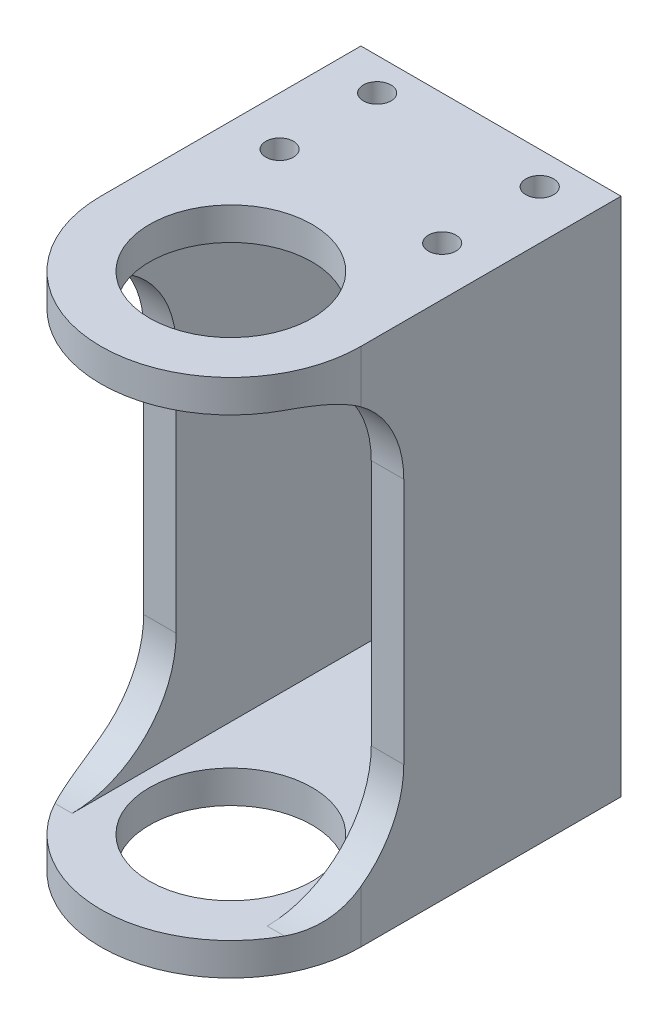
ISO-10303-21;
HEADER;
FILE_DESCRIPTION(('STEP AP214'),'2;1');
FILE_NAME('part.step','',(''),(''),'','','');
FILE_SCHEMA(('AUTOMOTIVE_DESIGN { 1 0 10303 214 1 1 1 1 }'));
ENDSEC;
DATA;
#1=APPLICATION_CONTEXT('core data for automotive mechanical design processes');
#2=APPLICATION_PROTOCOL_DEFINITION('international standard','automotive_design',2000,#1);
#3=PRODUCT_CONTEXT('',#1,'mechanical');
#4=PRODUCT('Part','Part','',(#3));
#5=PRODUCT_RELATED_PRODUCT_CATEGORY('part','',(#4));
#6=PRODUCT_DEFINITION_FORMATION('','',#4);
#7=PRODUCT_DEFINITION_CONTEXT('part definition',#1,'design');
#8=PRODUCT_DEFINITION('design','',#6,#7);
#9=PRODUCT_DEFINITION_SHAPE('','',#8);
#10=(LENGTH_UNIT() NAMED_UNIT(*) SI_UNIT(.MILLI.,.METRE.));
#11=(NAMED_UNIT(*) PLANE_ANGLE_UNIT() SI_UNIT($,.RADIAN.));
#12=(NAMED_UNIT(*) SI_UNIT($,.STERADIAN.) SOLID_ANGLE_UNIT());
#13=UNCERTAINTY_MEASURE_WITH_UNIT(LENGTH_MEASURE(1.E-05),#10,'distance_accuracy_value','');
#14=(GEOMETRIC_REPRESENTATION_CONTEXT(3) GLOBAL_UNCERTAINTY_ASSIGNED_CONTEXT((#13)) GLOBAL_UNIT_ASSIGNED_CONTEXT((#10,
#11,#12)) REPRESENTATION_CONTEXT('',''));
#15=CARTESIAN_POINT('',(0.,0.,0.));
#16=DIRECTION('',(0.,0.,1.));
#17=DIRECTION('',(1.,0.,0.));
#18=AXIS2_PLACEMENT_3D('',#15,#16,#17);
#19=CARTESIAN_POINT('',(-12.7,25.4,38.1));
#20=DIRECTION('',(0.,-1.,0.));
#21=DIRECTION('',(0.,0.,-1.));
#22=AXIS2_PLACEMENT_3D('',#19,#20,#21);
#23=PLANE('',#22);
#24=CARTESIAN_POINT('',(7.93750000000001,25.4,3.175));
#25=DIRECTION('',(0.,1.,0.));
#26=DIRECTION('',(0.,0.,1.));
#27=AXIS2_PLACEMENT_3D('',#24,#25,#26);
#28=CIRCLE('',#27,1.35254999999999);
#29=CARTESIAN_POINT('',(7.93750000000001,25.4,4.52754999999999));
#30=VERTEX_POINT('',#29);
#31=EDGE_CURVE('E456',#30,#30,#28,.T.);
#32=ORIENTED_EDGE('',*,*,#31,.F.);
#33=EDGE_LOOP('',(#32));
#34=FACE_BOUND('',#33,.T.);
#35=CARTESIAN_POINT('',(-7.93749999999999,25.4,12.7));
#36=DIRECTION('',(0.,1.,0.));
#37=DIRECTION('',(0.,0.,1.));
#38=AXIS2_PLACEMENT_3D('',#35,#36,#37);
#39=CIRCLE('',#38,1.35254999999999);
#40=CARTESIAN_POINT('',(-7.93749999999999,25.4,14.05255));
#41=VERTEX_POINT('',#40);
#42=EDGE_CURVE('E446',#41,#41,#39,.T.);
#43=ORIENTED_EDGE('',*,*,#42,.F.);
#44=EDGE_LOOP('',(#43));
#45=FACE_BOUND('',#44,.T.);
#46=CARTESIAN_POINT('',(0.,25.4,25.4));
#47=DIRECTION('',(0.,1.,0.));
#48=DIRECTION('',(0.,0.,1.));
#49=AXIS2_PLACEMENT_3D('',#46,#47,#48);
#50=CIRCLE('',#49,7.9375);
#51=CARTESIAN_POINT('',(0.,25.4,33.3375));
#52=VERTEX_POINT('',#51);
#53=EDGE_CURVE('E406',#52,#52,#50,.T.);
#54=ORIENTED_EDGE('',*,*,#53,.F.);
#55=EDGE_LOOP('',(#54));
#56=FACE_BOUND('',#55,.T.);
#57=DIRECTION('',(0.,0.,-1.));
#58=VECTOR('',#57,1.);
#59=CARTESIAN_POINT('',(-12.7,25.4,38.1));
#60=LINE('',#59,#58);
#61=CARTESIAN_POINT('',(-12.7,25.4,25.4));
#62=VERTEX_POINT('',#61);
#63=CARTESIAN_POINT('',(-12.7,25.4,0.));
#64=VERTEX_POINT('',#63);
#65=EDGE_CURVE('E155',#62,#64,#60,.T.);
#66=ORIENTED_EDGE('',*,*,#65,.F.);
#67=CARTESIAN_POINT('',(0.,25.4,25.4));
#68=DIRECTION('',(0.,-1.,0.));
#69=DIRECTION('',(0.,0.,-1.));
#70=AXIS2_PLACEMENT_3D('',#67,#68,#69);
#71=CIRCLE('',#70,12.7);
#72=CARTESIAN_POINT('',(12.7,25.4,25.4));
#73=VERTEX_POINT('',#72);
#74=EDGE_CURVE('E164',#73,#62,#71,.T.);
#75=ORIENTED_EDGE('',*,*,#74,.F.);
#76=DIRECTION('',(0.,0.,-1.));
#77=VECTOR('',#76,1.);
#78=CARTESIAN_POINT('',(12.7,25.4,38.1));
#79=LINE('',#78,#77);
#80=CARTESIAN_POINT('',(12.7,25.4,0.));
#81=VERTEX_POINT('',#80);
#82=EDGE_CURVE('E177',#73,#81,#79,.T.);
#83=ORIENTED_EDGE('',*,*,#82,.T.);
#84=DIRECTION('',(-1.,0.,0.));
#85=VECTOR('',#84,1.);
#86=CARTESIAN_POINT('',(-12.7,25.4,0.));
#87=LINE('',#86,#85);
#88=EDGE_CURVE('E175',#81,#64,#87,.T.);
#89=ORIENTED_EDGE('',*,*,#88,.T.);
#90=EDGE_LOOP('',(#66,#75,#83,#89));
#91=FACE_BOUND('',#90,.T.);
#92=CARTESIAN_POINT('',(-7.93749999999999,25.4,3.175));
#93=DIRECTION('',(0.,1.,0.));
#94=DIRECTION('',(0.,0.,1.));
#95=AXIS2_PLACEMENT_3D('',#92,#93,#94);
#96=CIRCLE('',#95,1.35254999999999);
#97=CARTESIAN_POINT('',(-7.93749999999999,25.4,4.52754999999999));
#98=VERTEX_POINT('',#97);
#99=EDGE_CURVE('E452',#98,#98,#96,.T.);
#100=ORIENTED_EDGE('',*,*,#99,.F.);
#101=EDGE_LOOP('',(#100));
#102=FACE_BOUND('',#101,.T.);
#103=CARTESIAN_POINT('',(7.93750000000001,25.4,12.7));
#104=DIRECTION('',(0.,1.,0.));
#105=DIRECTION('',(0.,0.,1.));
#106=AXIS2_PLACEMENT_3D('',#103,#104,#105);
#107=CIRCLE('',#106,1.35254999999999);
#108=CARTESIAN_POINT('',(7.93750000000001,25.4,14.05255));
#109=VERTEX_POINT('',#108);
#110=EDGE_CURVE('E460',#109,#109,#107,.T.);
#111=ORIENTED_EDGE('',*,*,#110,.F.);
#112=EDGE_LOOP('',(#111));
#113=FACE_BOUND('',#112,.T.);
#114=ADVANCED_FACE('F41',(#34,#45,#56,#91,#102,#113),#23,.F.);
#115=CARTESIAN_POINT('',(0.,-25.4,25.4));
#116=DIRECTION('',(0.,1.,0.));
#117=DIRECTION('',(0.,0.,1.));
#118=AXIS2_PLACEMENT_3D('',#115,#116,#117);
#119=CYLINDRICAL_SURFACE('',#118,12.7);
#120=DIRECTION('',(0.,1.,0.));
#121=VECTOR('',#120,1.);
#122=CARTESIAN_POINT('',(-12.7,-25.4,25.4));
#123=LINE('',#122,#121);
#124=CARTESIAN_POINT('',(-12.7,20.2826435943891,25.4));
#125=VERTEX_POINT('',#124);
#126=EDGE_CURVE('E151',#125,#62,#123,.T.);
#127=ORIENTED_EDGE('',*,*,#126,.F.);
#128=CARTESIAN_POINT('',(-12.7,20.2826435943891,25.4));
#129=CARTESIAN_POINT('',(-12.7000265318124,20.4220873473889,25.5917279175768));
#130=CARTESIAN_POINT('',(-12.6956591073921,20.5547842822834,25.7884183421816));
#131=CARTESIAN_POINT('',(-12.6769754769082,20.8059773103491,26.1903157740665));
#132=CARTESIAN_POINT('',(-12.6626553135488,20.9244677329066,26.395526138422));
#133=CARTESIAN_POINT('',(-12.6229187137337,21.1463432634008,26.8127400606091));
#134=CARTESIAN_POINT('',(-12.5975107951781,21.2497398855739,27.0247382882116));
#135=CARTESIAN_POINT('',(-12.534695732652,21.4409591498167,27.4538749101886));
#136=CARTESIAN_POINT('',(-12.4972909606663,21.5287848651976,27.6710122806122));
#137=CARTESIAN_POINT('',(-12.4096797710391,21.6887979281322,28.1092296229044));
#138=CARTESIAN_POINT('',(-12.3594345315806,21.7609366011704,28.3303196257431));
#139=CARTESIAN_POINT('',(-12.2458171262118,21.8891812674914,28.7737735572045));
#140=CARTESIAN_POINT('',(-12.1824448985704,21.9452871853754,28.9961374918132));
#141=CARTESIAN_POINT('',(-12.0425993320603,22.041647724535,29.4397797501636));
#142=CARTESIAN_POINT('',(-11.9661459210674,22.0819261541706,29.6610592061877));
#143=CARTESIAN_POINT('',(-11.8002904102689,22.1472935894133,30.1008883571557));
#144=CARTESIAN_POINT('',(-11.710893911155,22.1723891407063,30.319439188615));
#145=CARTESIAN_POINT('',(-11.5524195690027,22.2020843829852,30.677855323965));
#146=CARTESIAN_POINT('',(-11.4868978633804,22.2107623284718,30.8189835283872));
#147=CARTESIAN_POINT('',(-11.3507158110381,22.2222176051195,31.098723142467));
#148=CARTESIAN_POINT('',(-11.280063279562,22.2250037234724,31.2373379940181));
#149=CARTESIAN_POINT('',(-11.2068758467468,22.225,31.3746074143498));
#150=B_SPLINE_CURVE_WITH_KNOTS('',3,(#128,#129,#130,#131,#132,#133,#134,#135,#136,#137,#138,
#139,#140,#141,#142,#143,#144,#145,#146,#147,#148,#149),.UNSPECIFIED.,.F.,.F.,(4,2,2,2,2,2,2,2,
2,2,4),(0.,0.711103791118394,1.42249048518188,2.13333163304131,2.8440323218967,3.55690769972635,
4.26978643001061,4.98158867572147,5.69308382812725,6.16039691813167,6.62701255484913),.UNSPECIFIED.);
#151=CARTESIAN_POINT('',(-11.2068758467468,22.225,31.3746074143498));
#152=VERTEX_POINT('',#151);
#153=EDGE_CURVE('E360',#125,#152,#150,.T.);
#154=ORIENTED_EDGE('',*,*,#153,.T.);
#155=CARTESIAN_POINT('',(0.,22.225,25.4));
#156=DIRECTION('',(0.,-1.,0.));
#157=DIRECTION('',(0.,0.,-1.));
#158=AXIS2_PLACEMENT_3D('',#155,#156,#157);
#159=CIRCLE('',#158,12.7);
#160=CARTESIAN_POINT('',(11.2068758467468,22.225,31.3746074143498));
#161=VERTEX_POINT('',#160);
#162=EDGE_CURVE('E188',#152,#161,#159,.F.);
#163=ORIENTED_EDGE('',*,*,#162,.T.);
#164=CARTESIAN_POINT('',(11.2068758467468,22.225,31.3746074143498));
#165=CARTESIAN_POINT('',(11.3184718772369,22.2250346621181,31.1653753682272));
#166=CARTESIAN_POINT('',(11.4241567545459,22.2185371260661,30.9529281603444));
#167=CARTESIAN_POINT('',(11.6232312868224,22.1915376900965,30.5231153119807));
#168=CARTESIAN_POINT('',(11.7166156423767,22.1710297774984,30.30574759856));
#169=CARTESIAN_POINT('',(11.8904428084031,22.1150926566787,29.8679811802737));
#170=CARTESIAN_POINT('',(11.9708969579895,22.079676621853,29.6475853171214));
#171=CARTESIAN_POINT('',(12.1186854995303,21.9933044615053,29.2054896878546));
#172=CARTESIAN_POINT('',(12.1860226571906,21.9423516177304,28.9837902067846));
#173=CARTESIAN_POINT('',(12.3077771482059,21.8243683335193,28.5403284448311));
#174=CARTESIAN_POINT('',(12.3621537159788,21.757288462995,28.3185681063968));
#175=CARTESIAN_POINT('',(12.4580041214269,21.6070910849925,27.8777051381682));
#176=CARTESIAN_POINT('',(12.4994778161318,21.523973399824,27.6586025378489));
#177=CARTESIAN_POINT('',(12.5700514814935,21.3420910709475,27.2253539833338));
#178=CARTESIAN_POINT('',(12.5991697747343,21.2433498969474,27.0112011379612));
#179=CARTESIAN_POINT('',(12.645960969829,21.0306653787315,26.5894012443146));
#180=CARTESIAN_POINT('',(12.663638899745,20.9167287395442,26.3817513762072));
#181=CARTESIAN_POINT('',(12.6843345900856,20.7160822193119,26.0446419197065));
#182=CARTESIAN_POINT('',(12.6903042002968,20.6335032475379,25.9128751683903));
#183=CARTESIAN_POINT('',(12.6981352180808,20.4624558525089,25.6533779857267));
#184=CARTESIAN_POINT('',(12.7000027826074,20.3739964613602,25.5256417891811));
#185=CARTESIAN_POINT('',(12.7,20.2826435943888,25.4000000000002));
#186=B_SPLINE_CURVE_WITH_KNOTS('',3,(#164,#165,#166,#167,#168,#169,#170,#171,#172,#173,#174,
#175,#176,#177,#178,#179,#180,#181,#182,#183,#184,#185),.UNSPECIFIED.,.F.,.F.,(4,2,2,2,2,2,2,2,
2,2,4),(0.,0.711295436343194,1.42289632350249,2.13386972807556,2.8446930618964,3.55772351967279,
4.27076187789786,4.98273910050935,5.69440319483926,6.16105871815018,6.62701333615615),.UNSPECIFIED.);
#187=CARTESIAN_POINT('',(12.7,20.2826435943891,25.4));
#188=VERTEX_POINT('',#187);
#189=EDGE_CURVE('E216',#161,#188,#186,.T.);
#190=ORIENTED_EDGE('',*,*,#189,.T.);
#191=DIRECTION('',(0.,1.,0.));
#192=VECTOR('',#191,1.);
#193=CARTESIAN_POINT('',(12.7,-25.4,25.4));
#194=LINE('',#193,#192);
#195=EDGE_CURVE('E167',#188,#73,#194,.T.);
#196=ORIENTED_EDGE('',*,*,#195,.T.);
#197=ORIENTED_EDGE('',*,*,#74,.T.);
#198=EDGE_LOOP('',(#127,#154,#163,#190,#196,#197));
#199=FACE_BOUND('',#198,.T.);
#200=ADVANCED_FACE('F165',(#199),#119,.T.);
#201=CARTESIAN_POINT('',(-12.7,25.4,38.1));
#202=DIRECTION('',(1.,0.,0.));
#203=DIRECTION('',(0.,1.,0.));
#204=AXIS2_PLACEMENT_3D('',#201,#202,#203);
#205=PLANE('',#204);
#206=CARTESIAN_POINT('',(-12.7,-25.4,25.4));
#207=VERTEX_POINT('',#206);
#208=CARTESIAN_POINT('',(-12.7,-20.2826435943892,25.4));
#209=VERTEX_POINT('',#208);
#210=EDGE_CURVE('E64',#207,#209,#123,.T.);
#211=ORIENTED_EDGE('',*,*,#210,.T.);
#212=CARTESIAN_POINT('',(-12.7,-12.065,31.3746074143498));
#213=DIRECTION('',(1.,0.,0.));
#214=DIRECTION('',(0.,1.,0.));
#215=AXIS2_PLACEMENT_3D('',#212,#213,#214);
#216=CIRCLE('',#215,10.16);
#217=CARTESIAN_POINT('',(-12.7,-12.065,21.2146074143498));
#218=VERTEX_POINT('',#217);
#219=EDGE_CURVE('E377',#209,#218,#216,.T.);
#220=ORIENTED_EDGE('',*,*,#219,.T.);
#221=DIRECTION('',(0.,1.,0.));
#222=VECTOR('',#221,1.);
#223=CARTESIAN_POINT('',(-12.7,-22.225,21.2146074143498));
#224=LINE('',#223,#222);
#225=CARTESIAN_POINT('',(-12.7,12.065,21.2146074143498));
#226=VERTEX_POINT('',#225);
#227=EDGE_CURVE('E393',#218,#226,#224,.T.);
#228=ORIENTED_EDGE('',*,*,#227,.T.);
#229=CARTESIAN_POINT('',(-12.7,12.065,31.3746074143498));
#230=DIRECTION('',(1.,0.,0.));
#231=DIRECTION('',(0.,1.,0.));
#232=AXIS2_PLACEMENT_3D('',#229,#230,#231);
#233=CIRCLE('',#232,10.16);
#234=EDGE_CURVE('E159',#226,#125,#233,.T.);
#235=ORIENTED_EDGE('',*,*,#234,.T.);
#236=ORIENTED_EDGE('',*,*,#126,.T.);
#237=ORIENTED_EDGE('',*,*,#65,.T.);
#238=DIRECTION('',(0.,-1.,0.));
#239=VECTOR('',#238,1.);
#240=CARTESIAN_POINT('',(-12.7,25.4,0.));
#241=LINE('',#240,#239);
#242=CARTESIAN_POINT('',(-12.7,-25.4,0.));
#243=VERTEX_POINT('',#242);
#244=EDGE_CURVE('E331',#64,#243,#241,.T.);
#245=ORIENTED_EDGE('',*,*,#244,.T.);
#246=DIRECTION('',(0.,0.,-1.));
#247=VECTOR('',#246,1.);
#248=CARTESIAN_POINT('',(-12.7,-25.4,38.1));
#249=LINE('',#248,#247);
#250=EDGE_CURVE('E186',#207,#243,#249,.T.);
#251=ORIENTED_EDGE('',*,*,#250,.F.);
#252=EDGE_LOOP('',(#211,#220,#228,#235,#236,#237,#245,#251));
#253=FACE_BOUND('',#252,.T.);
#254=ADVANCED_FACE('F43',(#253),#205,.F.);
#255=CARTESIAN_POINT('',(-12.7,-25.4,0.));
#256=DIRECTION('',(0.,0.,1.));
#257=DIRECTION('',(1.,0.,0.));
#258=AXIS2_PLACEMENT_3D('',#255,#256,#257);
#259=PLANE('',#258);
#260=ORIENTED_EDGE('',*,*,#244,.F.);
#261=ORIENTED_EDGE('',*,*,#88,.F.);
#262=DIRECTION('',(0.,1.,0.));
#263=VECTOR('',#262,1.);
#264=CARTESIAN_POINT('',(12.7,25.4,0.));
#265=LINE('',#264,#263);
#266=CARTESIAN_POINT('',(12.7,-25.4,0.));
#267=VERTEX_POINT('',#266);
#268=EDGE_CURVE('E181',#267,#81,#265,.T.);
#269=ORIENTED_EDGE('',*,*,#268,.F.);
#270=DIRECTION('',(1.,0.,0.));
#271=VECTOR('',#270,1.);
#272=CARTESIAN_POINT('',(-12.7,-25.4,0.));
#273=LINE('',#272,#271);
#274=EDGE_CURVE('E299',#243,#267,#273,.T.);
#275=ORIENTED_EDGE('',*,*,#274,.F.);
#276=EDGE_LOOP('',(#260,#261,#269,#275));
#277=FACE_BOUND('',#276,.T.);
#278=DIRECTION('',(0.,-1.,0.));
#279=VECTOR('',#278,1.);
#280=CARTESIAN_POINT('',(-9.525,22.225,0.));
#281=LINE('',#280,#279);
#282=CARTESIAN_POINT('',(-9.525,22.225,0.));
#283=VERTEX_POINT('',#282);
#284=CARTESIAN_POINT('',(-9.525,-22.225,0.));
#285=VERTEX_POINT('',#284);
#286=EDGE_CURVE('E311',#283,#285,#281,.T.);
#287=ORIENTED_EDGE('',*,*,#286,.T.);
#288=DIRECTION('',(1.,0.,0.));
#289=VECTOR('',#288,1.);
#290=CARTESIAN_POINT('',(-9.525,-22.225,0.));
#291=LINE('',#290,#289);
#292=CARTESIAN_POINT('',(9.52500000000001,-22.225,0.));
#293=VERTEX_POINT('',#292);
#294=EDGE_CURVE('E314',#285,#293,#291,.T.);
#295=ORIENTED_EDGE('',*,*,#294,.T.);
#296=DIRECTION('',(0.,1.,0.));
#297=VECTOR('',#296,1.);
#298=CARTESIAN_POINT('',(9.525,22.225,0.));
#299=LINE('',#298,#297);
#300=CARTESIAN_POINT('',(9.525,22.225,0.));
#301=VERTEX_POINT('',#300);
#302=EDGE_CURVE('E317',#293,#301,#299,.T.);
#303=ORIENTED_EDGE('',*,*,#302,.T.);
#304=DIRECTION('',(-1.,0.,0.));
#305=VECTOR('',#304,1.);
#306=CARTESIAN_POINT('',(-9.525,22.225,0.));
#307=LINE('',#306,#305);
#308=EDGE_CURVE('E320',#301,#283,#307,.T.);
#309=ORIENTED_EDGE('',*,*,#308,.T.);
#310=EDGE_LOOP('',(#287,#295,#303,#309));
#311=FACE_BOUND('',#310,.T.);
#312=ADVANCED_FACE('F280',(#277,#311),#259,.F.);
#313=CARTESIAN_POINT('',(-12.7,-25.4,38.1));
#314=DIRECTION('',(0.,1.,0.));
#315=DIRECTION('',(0.,0.,1.));
#316=AXIS2_PLACEMENT_3D('',#313,#314,#315);
#317=PLANE('',#316);
#318=CARTESIAN_POINT('',(0.,-25.4,25.4));
#319=DIRECTION('',(0.,1.,0.));
#320=DIRECTION('',(0.,0.,1.));
#321=AXIS2_PLACEMENT_3D('',#318,#319,#320);
#322=CIRCLE('',#321,7.9375);
#323=CARTESIAN_POINT('',(0.,-25.4,33.3375));
#324=VERTEX_POINT('',#323);
#325=EDGE_CURVE('E195',#324,#324,#322,.T.);
#326=ORIENTED_EDGE('',*,*,#325,.T.);
#327=EDGE_LOOP('',(#326));
#328=FACE_BOUND('',#327,.T.);
#329=DIRECTION('',(0.,0.,-1.));
#330=VECTOR('',#329,1.);
#331=CARTESIAN_POINT('',(12.7,-25.4,38.1));
#332=LINE('',#331,#330);
#333=CARTESIAN_POINT('',(12.7,-25.4,25.4));
#334=VERTEX_POINT('',#333);
#335=EDGE_CURVE('E179',#334,#267,#332,.T.);
#336=ORIENTED_EDGE('',*,*,#335,.F.);
#337=CARTESIAN_POINT('',(0.,-25.4,25.4));
#338=DIRECTION('',(0.,-1.,0.));
#339=DIRECTION('',(0.,0.,-1.));
#340=AXIS2_PLACEMENT_3D('',#337,#338,#339);
#341=CIRCLE('',#340,12.7);
#342=EDGE_CURVE('E170',#334,#207,#341,.T.);
#343=ORIENTED_EDGE('',*,*,#342,.T.);
#344=ORIENTED_EDGE('',*,*,#250,.T.);
#345=ORIENTED_EDGE('',*,*,#274,.T.);
#346=EDGE_LOOP('',(#336,#343,#344,#345));
#347=FACE_BOUND('',#346,.T.);
#348=ADVANCED_FACE('F285',(#328,#347),#317,.F.);
#349=CARTESIAN_POINT('',(12.7,25.4,38.1));
#350=DIRECTION('',(-1.,0.,0.));
#351=DIRECTION('',(0.,-1.,0.));
#352=AXIS2_PLACEMENT_3D('',#349,#350,#351);
#353=PLANE('',#352);
#354=ORIENTED_EDGE('',*,*,#195,.F.);
#355=CARTESIAN_POINT('',(12.7,12.065,31.3746074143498));
#356=DIRECTION('',(-1.,0.,0.));
#357=DIRECTION('',(0.,-1.,0.));
#358=AXIS2_PLACEMENT_3D('',#355,#356,#357);
#359=CIRCLE('',#358,10.16);
#360=CARTESIAN_POINT('',(12.7,12.065,21.2146074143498));
#361=VERTEX_POINT('',#360);
#362=EDGE_CURVE('E223',#188,#361,#359,.T.);
#363=ORIENTED_EDGE('',*,*,#362,.T.);
#364=DIRECTION('',(0.,1.,0.));
#365=VECTOR('',#364,1.);
#366=CARTESIAN_POINT('',(12.7,-22.225,21.2146074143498));
#367=LINE('',#366,#365);
#368=CARTESIAN_POINT('',(12.7,-12.065,21.2146074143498));
#369=VERTEX_POINT('',#368);
#370=EDGE_CURVE('E398',#369,#361,#367,.T.);
#371=ORIENTED_EDGE('',*,*,#370,.F.);
#372=CARTESIAN_POINT('',(12.7,-12.065,31.3746074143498));
#373=DIRECTION('',(-1.,0.,0.));
#374=DIRECTION('',(0.,-1.,0.));
#375=AXIS2_PLACEMENT_3D('',#372,#373,#374);
#376=CIRCLE('',#375,10.16);
#377=CARTESIAN_POINT('',(12.7,-20.2826435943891,25.4));
#378=VERTEX_POINT('',#377);
#379=EDGE_CURVE('E303',#369,#378,#376,.T.);
#380=ORIENTED_EDGE('',*,*,#379,.T.);
#381=EDGE_CURVE('E56',#334,#378,#194,.T.);
#382=ORIENTED_EDGE('',*,*,#381,.F.);
#383=ORIENTED_EDGE('',*,*,#335,.T.);
#384=ORIENTED_EDGE('',*,*,#268,.T.);
#385=ORIENTED_EDGE('',*,*,#82,.F.);
#386=EDGE_LOOP('',(#354,#363,#371,#380,#382,#383,#384,#385));
#387=FACE_BOUND('',#386,.T.);
#388=ADVANCED_FACE('F282',(#387),#353,.F.);
#389=CARTESIAN_POINT('',(-9.525,22.225,38.1));
#390=DIRECTION('',(1.,0.,0.));
#391=DIRECTION('',(0.,1.,0.));
#392=AXIS2_PLACEMENT_3D('',#389,#390,#391);
#393=PLANE('',#392);
#394=DIRECTION('',(0.,1.,0.));
#395=VECTOR('',#394,1.);
#396=CARTESIAN_POINT('',(-9.525,22.225,21.2146074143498));
#397=LINE('',#396,#395);
#398=CARTESIAN_POINT('',(-9.525,-12.065,21.2146074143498));
#399=VERTEX_POINT('',#398);
#400=CARTESIAN_POINT('',(-9.525,12.065,21.2146074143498));
#401=VERTEX_POINT('',#400);
#402=EDGE_CURVE('E404',#399,#401,#397,.T.);
#403=ORIENTED_EDGE('',*,*,#402,.F.);
#404=CARTESIAN_POINT('',(-9.525,-12.065,31.3746074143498));
#405=DIRECTION('',(1.,0.,0.));
#406=DIRECTION('',(0.,1.,0.));
#407=AXIS2_PLACEMENT_3D('',#404,#405,#406);
#408=CIRCLE('',#407,10.16);
#409=CARTESIAN_POINT('',(-9.525,-22.225,31.3746074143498));
#410=VERTEX_POINT('',#409);
#411=EDGE_CURVE('E341',#399,#410,#408,.F.);
#412=ORIENTED_EDGE('',*,*,#411,.T.);
#413=DIRECTION('',(0.,0.,-1.));
#414=VECTOR('',#413,1.);
#415=CARTESIAN_POINT('',(-9.525,-22.225,38.1));
#416=LINE('',#415,#414);
#417=EDGE_CURVE('E329',#410,#285,#416,.T.);
#418=ORIENTED_EDGE('',*,*,#417,.T.);
#419=ORIENTED_EDGE('',*,*,#286,.F.);
#420=DIRECTION('',(0.,0.,-1.));
#421=VECTOR('',#420,1.);
#422=CARTESIAN_POINT('',(-9.525,22.225,38.1));
#423=LINE('',#422,#421);
#424=CARTESIAN_POINT('',(-9.525,22.225,31.3746074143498));
#425=VERTEX_POINT('',#424);
#426=EDGE_CURVE('E323',#425,#283,#423,.T.);
#427=ORIENTED_EDGE('',*,*,#426,.F.);
#428=CARTESIAN_POINT('',(-9.525,12.065,31.3746074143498));
#429=DIRECTION('',(1.,0.,0.));
#430=DIRECTION('',(0.,1.,0.));
#431=AXIS2_PLACEMENT_3D('',#428,#429,#430);
#432=CIRCLE('',#431,10.16);
#433=EDGE_CURVE('E362',#425,#401,#432,.F.);
#434=ORIENTED_EDGE('',*,*,#433,.T.);
#435=EDGE_LOOP('',(#403,#412,#418,#419,#427,#434));
#436=FACE_BOUND('',#435,.T.);
#437=ADVANCED_FACE('F284',(#436),#393,.T.);
#438=CARTESIAN_POINT('',(-9.525,-22.225,38.1));
#439=DIRECTION('',(0.,1.,0.));
#440=DIRECTION('',(-1.,0.,0.));
#441=AXIS2_PLACEMENT_3D('',#438,#439,#440);
#442=PLANE('',#441);
#443=CARTESIAN_POINT('',(0.,-22.225,25.4));
#444=DIRECTION('',(0.,1.,0.));
#445=DIRECTION('',(-1.,0.,0.));
#446=AXIS2_PLACEMENT_3D('',#443,#444,#445);
#447=CIRCLE('',#446,7.9375);
#448=CARTESIAN_POINT('',(-7.9375,-22.225,25.4));
#449=VERTEX_POINT('',#448);
#450=EDGE_CURVE('E171',#449,#449,#447,.T.);
#451=ORIENTED_EDGE('',*,*,#450,.F.);
#452=EDGE_LOOP('',(#451));
#453=FACE_BOUND('',#452,.T.);
#454=ORIENTED_EDGE('',*,*,#417,.F.);
#455=DIRECTION('',(1.,0.,0.));
#456=VECTOR('',#455,1.);
#457=CARTESIAN_POINT('',(-9.525,-22.225,31.3746074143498));
#458=LINE('',#457,#456);
#459=CARTESIAN_POINT('',(-11.2068758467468,-22.225,31.3746074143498));
#460=VERTEX_POINT('',#459);
#461=EDGE_CURVE('E214',#410,#460,#458,.F.);
#462=ORIENTED_EDGE('',*,*,#461,.T.);
#463=CARTESIAN_POINT('',(0.,-22.225,25.4));
#464=DIRECTION('',(0.,1.,0.));
#465=DIRECTION('',(-1.,0.,0.));
#466=AXIS2_PLACEMENT_3D('',#463,#464,#465);
#467=CIRCLE('',#466,12.7);
#468=CARTESIAN_POINT('',(11.2068758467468,-22.225,31.3746074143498));
#469=VERTEX_POINT('',#468);
#470=EDGE_CURVE('E308',#469,#460,#467,.F.);
#471=ORIENTED_EDGE('',*,*,#470,.F.);
#472=DIRECTION('',(1.,0.,0.));
#473=VECTOR('',#472,1.);
#474=CARTESIAN_POINT('',(-9.525,-22.225,31.3746074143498));
#475=LINE('',#474,#473);
#476=CARTESIAN_POINT('',(9.52500000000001,-22.225,31.3746074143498));
#477=VERTEX_POINT('',#476);
#478=EDGE_CURVE('E211',#469,#477,#475,.F.);
#479=ORIENTED_EDGE('',*,*,#478,.T.);
#480=DIRECTION('',(0.,0.,-1.));
#481=VECTOR('',#480,1.);
#482=CARTESIAN_POINT('',(9.52500000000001,-22.225,38.1));
#483=LINE('',#482,#481);
#484=EDGE_CURVE('E327',#477,#293,#483,.T.);
#485=ORIENTED_EDGE('',*,*,#484,.T.);
#486=ORIENTED_EDGE('',*,*,#294,.F.);
#487=EDGE_LOOP('',(#454,#462,#471,#479,#485,#486));
#488=FACE_BOUND('',#487,.T.);
#489=ADVANCED_FACE('F344',(#453,#488),#442,.T.);
#490=CARTESIAN_POINT('',(9.525,22.225,38.1));
#491=DIRECTION('',(-1.,0.,0.));
#492=DIRECTION('',(0.,-1.,0.));
#493=AXIS2_PLACEMENT_3D('',#490,#491,#492);
#494=PLANE('',#493);
#495=DIRECTION('',(0.,-1.,0.));
#496=VECTOR('',#495,1.);
#497=CARTESIAN_POINT('',(9.525,22.225,21.2146074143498));
#498=LINE('',#497,#496);
#499=CARTESIAN_POINT('',(9.525,12.065,21.2146074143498));
#500=VERTEX_POINT('',#499);
#501=CARTESIAN_POINT('',(9.52500000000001,-12.065,21.2146074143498));
#502=VERTEX_POINT('',#501);
#503=EDGE_CURVE('E397',#500,#502,#498,.T.);
#504=ORIENTED_EDGE('',*,*,#503,.F.);
#505=CARTESIAN_POINT('',(9.525,12.065,31.3746074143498));
#506=DIRECTION('',(-1.,0.,0.));
#507=DIRECTION('',(0.,-1.,0.));
#508=AXIS2_PLACEMENT_3D('',#505,#506,#507);
#509=CIRCLE('',#508,10.16);
#510=CARTESIAN_POINT('',(9.525,22.225,31.3746074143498));
#511=VERTEX_POINT('',#510);
#512=EDGE_CURVE('E354',#500,#511,#509,.F.);
#513=ORIENTED_EDGE('',*,*,#512,.T.);
#514=DIRECTION('',(0.,0.,-1.));
#515=VECTOR('',#514,1.);
#516=CARTESIAN_POINT('',(9.525,22.225,38.1));
#517=LINE('',#516,#515);
#518=EDGE_CURVE('E325',#511,#301,#517,.T.);
#519=ORIENTED_EDGE('',*,*,#518,.T.);
#520=ORIENTED_EDGE('',*,*,#302,.F.);
#521=ORIENTED_EDGE('',*,*,#484,.F.);
#522=CARTESIAN_POINT('',(9.52500000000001,-12.065,31.3746074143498));
#523=DIRECTION('',(-1.,0.,0.));
#524=DIRECTION('',(0.,-1.,0.));
#525=AXIS2_PLACEMENT_3D('',#522,#523,#524);
#526=CIRCLE('',#525,10.16);
#527=EDGE_CURVE('E13',#477,#502,#526,.F.);
#528=ORIENTED_EDGE('',*,*,#527,.T.);
#529=EDGE_LOOP('',(#504,#513,#519,#520,#521,#528));
#530=FACE_BOUND('',#529,.T.);
#531=ADVANCED_FACE('F351',(#530),#494,.T.);
#532=CARTESIAN_POINT('',(-9.525,22.225,38.1));
#533=DIRECTION('',(0.,-1.,0.));
#534=DIRECTION('',(0.,0.,-1.));
#535=AXIS2_PLACEMENT_3D('',#532,#533,#534);
#536=PLANE('',#535);
#537=CARTESIAN_POINT('',(7.93750000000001,22.225,12.7));
#538=DIRECTION('',(0.,-1.,0.));
#539=DIRECTION('',(0.,0.,-1.));
#540=AXIS2_PLACEMENT_3D('',#537,#538,#539);
#541=CIRCLE('',#540,1.35254999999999);
#542=CARTESIAN_POINT('',(7.93750000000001,22.225,11.34745));
#543=VERTEX_POINT('',#542);
#544=EDGE_CURVE('E431',#543,#543,#541,.T.);
#545=ORIENTED_EDGE('',*,*,#544,.F.);
#546=EDGE_LOOP('',(#545));
#547=FACE_BOUND('',#546,.T.);
#548=CARTESIAN_POINT('',(7.93750000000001,22.225,3.175));
#549=DIRECTION('',(0.,-1.,0.));
#550=DIRECTION('',(0.,0.,-1.));
#551=AXIS2_PLACEMENT_3D('',#548,#549,#550);
#552=CIRCLE('',#551,1.35254999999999);
#553=CARTESIAN_POINT('',(7.93750000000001,22.225,1.82245000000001));
#554=VERTEX_POINT('',#553);
#555=EDGE_CURVE('E435',#554,#554,#552,.T.);
#556=ORIENTED_EDGE('',*,*,#555,.F.);
#557=EDGE_LOOP('',(#556));
#558=FACE_BOUND('',#557,.T.);
#559=CARTESIAN_POINT('',(-7.93749999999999,22.225,3.175));
#560=DIRECTION('',(0.,-1.,0.));
#561=DIRECTION('',(0.,0.,-1.));
#562=AXIS2_PLACEMENT_3D('',#559,#560,#561);
#563=CIRCLE('',#562,1.35254999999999);
#564=CARTESIAN_POINT('',(-7.93749999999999,22.225,1.82245000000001));
#565=VERTEX_POINT('',#564);
#566=EDGE_CURVE('E439',#565,#565,#563,.T.);
#567=ORIENTED_EDGE('',*,*,#566,.F.);
#568=EDGE_LOOP('',(#567));
#569=FACE_BOUND('',#568,.T.);
#570=CARTESIAN_POINT('',(-7.93749999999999,22.225,12.7));
#571=DIRECTION('',(0.,-1.,0.));
#572=DIRECTION('',(0.,0.,-1.));
#573=AXIS2_PLACEMENT_3D('',#570,#571,#572);
#574=CIRCLE('',#573,1.35254999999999);
#575=CARTESIAN_POINT('',(-7.93749999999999,22.225,11.34745));
#576=VERTEX_POINT('',#575);
#577=EDGE_CURVE('E443',#576,#576,#574,.T.);
#578=ORIENTED_EDGE('',*,*,#577,.F.);
#579=EDGE_LOOP('',(#578));
#580=FACE_BOUND('',#579,.T.);
#581=CARTESIAN_POINT('',(0.,22.225,25.4));
#582=DIRECTION('',(0.,-1.,0.));
#583=DIRECTION('',(0.,0.,-1.));
#584=AXIS2_PLACEMENT_3D('',#581,#582,#583);
#585=CIRCLE('',#584,7.9375);
#586=CARTESIAN_POINT('',(0.,22.225,17.4625));
#587=VERTEX_POINT('',#586);
#588=EDGE_CURVE('E192',#587,#587,#585,.T.);
#589=ORIENTED_EDGE('',*,*,#588,.F.);
#590=EDGE_LOOP('',(#589));
#591=FACE_BOUND('',#590,.T.);
#592=ORIENTED_EDGE('',*,*,#518,.F.);
#593=DIRECTION('',(1.,0.,0.));
#594=VECTOR('',#593,1.);
#595=CARTESIAN_POINT('',(-9.525,22.225,31.3746074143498));
#596=LINE('',#595,#594);
#597=EDGE_CURVE('E198',#511,#161,#596,.T.);
#598=ORIENTED_EDGE('',*,*,#597,.T.);
#599=ORIENTED_EDGE('',*,*,#162,.F.);
#600=DIRECTION('',(1.,0.,0.));
#601=VECTOR('',#600,1.);
#602=CARTESIAN_POINT('',(-9.525,22.225,31.3746074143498));
#603=LINE('',#602,#601);
#604=EDGE_CURVE('E191',#152,#425,#603,.T.);
#605=ORIENTED_EDGE('',*,*,#604,.T.);
#606=ORIENTED_EDGE('',*,*,#426,.T.);
#607=ORIENTED_EDGE('',*,*,#308,.F.);
#608=EDGE_LOOP('',(#592,#598,#599,#605,#606,#607));
#609=FACE_BOUND('',#608,.T.);
#610=ADVANCED_FACE('F268',(#547,#558,#569,#580,#591,#609),#536,.T.);
#611=ORIENTED_EDGE('',*,*,#381,.T.);
#612=CARTESIAN_POINT('',(12.7,-20.2826435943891,25.4));
#613=CARTESIAN_POINT('',(12.7000265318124,-20.4220873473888,25.5917279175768));
#614=CARTESIAN_POINT('',(12.6956591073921,-20.5547842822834,25.7884183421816));
#615=CARTESIAN_POINT('',(12.6769754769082,-20.8059773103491,26.1903157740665));
#616=CARTESIAN_POINT('',(12.6626553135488,-20.9244677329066,26.395526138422));
#617=CARTESIAN_POINT('',(12.6229187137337,-21.1463432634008,26.8127400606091));
#618=CARTESIAN_POINT('',(12.5975107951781,-21.2497398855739,27.0247382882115));
#619=CARTESIAN_POINT('',(12.534695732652,-21.4409591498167,27.4538749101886));
#620=CARTESIAN_POINT('',(12.4972909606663,-21.5287848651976,27.6710122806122));
#621=CARTESIAN_POINT('',(12.4096797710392,-21.6887979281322,28.1092296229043));
#622=CARTESIAN_POINT('',(12.3594345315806,-21.7609366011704,28.3303196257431));
#623=CARTESIAN_POINT('',(12.2458171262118,-21.8891812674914,28.7737735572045));
#624=CARTESIAN_POINT('',(12.1824448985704,-21.9452871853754,28.9961374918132));
#625=CARTESIAN_POINT('',(12.0425993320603,-22.041647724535,29.4397797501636));
#626=CARTESIAN_POINT('',(11.9661459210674,-22.0819261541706,29.6610592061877));
#627=CARTESIAN_POINT('',(11.8002904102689,-22.1472935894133,30.1008883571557));
#628=CARTESIAN_POINT('',(11.710893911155,-22.1723891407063,30.319439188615));
#629=CARTESIAN_POINT('',(11.5524195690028,-22.2020843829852,30.6778553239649));
#630=CARTESIAN_POINT('',(11.4868978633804,-22.2107623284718,30.8189835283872));
#631=CARTESIAN_POINT('',(11.3507158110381,-22.2222176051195,31.098723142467));
#632=CARTESIAN_POINT('',(11.280063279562,-22.2250037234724,31.2373379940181));
#633=CARTESIAN_POINT('',(11.2068758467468,-22.225,31.3746074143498));
#634=B_SPLINE_CURVE_WITH_KNOTS('',3,(#612,#613,#614,#615,#616,#617,#618,#619,#620,#621,#622,
#623,#624,#625,#626,#627,#628,#629,#630,#631,#632,#633),.UNSPECIFIED.,.F.,.F.,(4,2,2,2,2,2,2,2,
2,2,4),(0.,0.711103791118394,1.42249048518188,2.13333163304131,2.8440323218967,3.55690769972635,
4.26978643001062,4.98158867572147,5.69308382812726,6.16039691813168,6.62701255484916),.UNSPECIFIED.);
#635=EDGE_CURVE('E49',#378,#469,#634,.T.);
#636=ORIENTED_EDGE('',*,*,#635,.T.);
#637=ORIENTED_EDGE('',*,*,#470,.T.);
#638=CARTESIAN_POINT('',(-11.2068758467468,-22.225,31.3746074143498));
#639=CARTESIAN_POINT('',(-11.3184718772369,-22.2250346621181,31.1653753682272));
#640=CARTESIAN_POINT('',(-11.4241567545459,-22.2185371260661,30.9529281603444));
#641=CARTESIAN_POINT('',(-11.6232312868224,-22.1915376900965,30.5231153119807));
#642=CARTESIAN_POINT('',(-11.7166156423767,-22.1710297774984,30.30574759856));
#643=CARTESIAN_POINT('',(-11.8904428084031,-22.1150926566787,29.8679811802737));
#644=CARTESIAN_POINT('',(-11.9708969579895,-22.079676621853,29.6475853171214));
#645=CARTESIAN_POINT('',(-12.1186854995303,-21.9933044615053,29.2054896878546));
#646=CARTESIAN_POINT('',(-12.1860226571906,-21.9423516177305,28.9837902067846));
#647=CARTESIAN_POINT('',(-12.3077771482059,-21.8243683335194,28.5403284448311));
#648=CARTESIAN_POINT('',(-12.3621537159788,-21.757288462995,28.3185681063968));
#649=CARTESIAN_POINT('',(-12.4580041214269,-21.6070910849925,27.8777051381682));
#650=CARTESIAN_POINT('',(-12.4994778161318,-21.523973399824,27.6586025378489));
#651=CARTESIAN_POINT('',(-12.5700514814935,-21.3420910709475,27.2253539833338));
#652=CARTESIAN_POINT('',(-12.5991697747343,-21.2433498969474,27.0112011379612));
#653=CARTESIAN_POINT('',(-12.645960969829,-21.0306653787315,26.5894012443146));
#654=CARTESIAN_POINT('',(-12.663638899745,-20.9167287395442,26.3817513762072));
#655=CARTESIAN_POINT('',(-12.6843345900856,-20.7160822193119,26.0446419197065));
#656=CARTESIAN_POINT('',(-12.6903042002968,-20.6335032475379,25.9128751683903));
#657=CARTESIAN_POINT('',(-12.6981352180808,-20.462455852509,25.6533779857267));
#658=CARTESIAN_POINT('',(-12.7000027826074,-20.3739964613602,25.5256417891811));
#659=CARTESIAN_POINT('',(-12.7,-20.2826435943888,25.4000000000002));
#660=B_SPLINE_CURVE_WITH_KNOTS('',3,(#638,#639,#640,#641,#642,#643,#644,#645,#646,#647,#648,
#649,#650,#651,#652,#653,#654,#655,#656,#657,#658,#659),.UNSPECIFIED.,.F.,.F.,(4,2,2,2,2,2,2,2,
2,2,4),(0.,0.711295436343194,1.42289632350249,2.13386972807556,2.8446930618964,3.5577235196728,
4.27076187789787,4.98273910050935,5.69440319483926,6.16105871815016,6.62701333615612),.UNSPECIFIED.);
#661=EDGE_CURVE('E372',#460,#209,#660,.T.);
#662=ORIENTED_EDGE('',*,*,#661,.T.);
#663=ORIENTED_EDGE('',*,*,#210,.F.);
#664=ORIENTED_EDGE('',*,*,#342,.F.);
#665=EDGE_LOOP('',(#611,#636,#637,#662,#663,#664));
#666=FACE_BOUND('',#665,.T.);
#667=ADVANCED_FACE('F225',(#666),#119,.T.);
#668=CARTESIAN_POINT('',(0.,-25.4,25.4));
#669=DIRECTION('',(0.,1.,0.));
#670=DIRECTION('',(0.,0.,1.));
#671=AXIS2_PLACEMENT_3D('',#668,#669,#670);
#672=CYLINDRICAL_SURFACE('',#671,7.9375);
#673=ORIENTED_EDGE('',*,*,#588,.T.);
#674=EDGE_LOOP('',(#673));
#675=FACE_BOUND('',#674,.T.);
#676=ORIENTED_EDGE('',*,*,#53,.T.);
#677=EDGE_LOOP('',(#676));
#678=FACE_BOUND('',#677,.T.);
#679=ADVANCED_FACE('F258',(#675,#678),#672,.F.);
#680=ORIENTED_EDGE('',*,*,#450,.T.);
#681=EDGE_LOOP('',(#680));
#682=FACE_BOUND('',#681,.T.);
#683=ORIENTED_EDGE('',*,*,#325,.F.);
#684=EDGE_LOOP('',(#683));
#685=FACE_BOUND('',#684,.T.);
#686=ADVANCED_FACE('F260',(#682,#685),#672,.F.);
#687=CARTESIAN_POINT('',(-12.7,-22.225,21.2146074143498));
#688=DIRECTION('',(0.,0.,-1.));
#689=DIRECTION('',(-1.,0.,0.));
#690=AXIS2_PLACEMENT_3D('',#687,#688,#689);
#691=PLANE('',#690);
#692=ORIENTED_EDGE('',*,*,#402,.T.);
#693=DIRECTION('',(1.,0.,0.));
#694=VECTOR('',#693,1.);
#695=CARTESIAN_POINT('',(-12.7,12.065,21.2146074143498));
#696=LINE('',#695,#694);
#697=EDGE_CURVE('E209',#401,#226,#696,.F.);
#698=ORIENTED_EDGE('',*,*,#697,.T.);
#699=ORIENTED_EDGE('',*,*,#227,.F.);
#700=DIRECTION('',(1.,0.,0.));
#701=VECTOR('',#700,1.);
#702=CARTESIAN_POINT('',(-12.7,-12.065,21.2146074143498));
#703=LINE('',#702,#701);
#704=EDGE_CURVE('E206',#218,#399,#703,.T.);
#705=ORIENTED_EDGE('',*,*,#704,.T.);
#706=EDGE_LOOP('',(#692,#698,#699,#705));
#707=FACE_BOUND('',#706,.T.);
#708=ADVANCED_FACE('F256',(#707),#691,.F.);
#709=ORIENTED_EDGE('',*,*,#370,.T.);
#710=DIRECTION('',(1.,0.,0.));
#711=VECTOR('',#710,1.);
#712=CARTESIAN_POINT('',(-12.7,12.065,21.2146074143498));
#713=LINE('',#712,#711);
#714=EDGE_CURVE('E204',#361,#500,#713,.F.);
#715=ORIENTED_EDGE('',*,*,#714,.T.);
#716=ORIENTED_EDGE('',*,*,#503,.T.);
#717=DIRECTION('',(1.,0.,0.));
#718=VECTOR('',#717,1.);
#719=CARTESIAN_POINT('',(-12.7,-12.065,21.2146074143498));
#720=LINE('',#719,#718);
#721=EDGE_CURVE('E201',#502,#369,#720,.T.);
#722=ORIENTED_EDGE('',*,*,#721,.T.);
#723=EDGE_LOOP('',(#709,#715,#716,#722));
#724=FACE_BOUND('',#723,.T.);
#725=ADVANCED_FACE('F253',(#724),#691,.F.);
#726=CARTESIAN_POINT('',(-7.93749999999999,25.4,12.7));
#727=DIRECTION('',(0.,1.,0.));
#728=DIRECTION('',(0.,0.,1.));
#729=AXIS2_PLACEMENT_3D('',#726,#727,#728);
#730=CYLINDRICAL_SURFACE('',#729,1.35254999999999);
#731=ORIENTED_EDGE('',*,*,#42,.T.);
#732=EDGE_LOOP('',(#731));
#733=FACE_BOUND('',#732,.T.);
#734=ORIENTED_EDGE('',*,*,#577,.T.);
#735=EDGE_LOOP('',(#734));
#736=FACE_BOUND('',#735,.T.);
#737=ADVANCED_FACE('F249',(#733,#736),#730,.F.);
#738=CARTESIAN_POINT('',(-7.93749999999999,25.4,3.175));
#739=DIRECTION('',(0.,1.,0.));
#740=DIRECTION('',(0.,0.,1.));
#741=AXIS2_PLACEMENT_3D('',#738,#739,#740);
#742=CYLINDRICAL_SURFACE('',#741,1.35254999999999);
#743=ORIENTED_EDGE('',*,*,#99,.T.);
#744=EDGE_LOOP('',(#743));
#745=FACE_BOUND('',#744,.T.);
#746=ORIENTED_EDGE('',*,*,#566,.T.);
#747=EDGE_LOOP('',(#746));
#748=FACE_BOUND('',#747,.T.);
#749=ADVANCED_FACE('F245',(#745,#748),#742,.F.);
#750=CARTESIAN_POINT('',(7.93750000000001,25.4,3.175));
#751=DIRECTION('',(0.,1.,0.));
#752=DIRECTION('',(0.,0.,1.));
#753=AXIS2_PLACEMENT_3D('',#750,#751,#752);
#754=CYLINDRICAL_SURFACE('',#753,1.35254999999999);
#755=ORIENTED_EDGE('',*,*,#31,.T.);
#756=EDGE_LOOP('',(#755));
#757=FACE_BOUND('',#756,.T.);
#758=ORIENTED_EDGE('',*,*,#555,.T.);
#759=EDGE_LOOP('',(#758));
#760=FACE_BOUND('',#759,.T.);
#761=ADVANCED_FACE('F241',(#757,#760),#754,.F.);
#762=CARTESIAN_POINT('',(7.93750000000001,25.4,12.7));
#763=DIRECTION('',(0.,1.,0.));
#764=DIRECTION('',(0.,0.,1.));
#765=AXIS2_PLACEMENT_3D('',#762,#763,#764);
#766=CYLINDRICAL_SURFACE('',#765,1.35254999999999);
#767=ORIENTED_EDGE('',*,*,#110,.T.);
#768=EDGE_LOOP('',(#767));
#769=FACE_BOUND('',#768,.T.);
#770=ORIENTED_EDGE('',*,*,#544,.T.);
#771=EDGE_LOOP('',(#770));
#772=FACE_BOUND('',#771,.T.);
#773=ADVANCED_FACE('F235',(#769,#772),#766,.F.);
#774=CARTESIAN_POINT('',(-9.525,12.065,31.3746074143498));
#775=DIRECTION('',(1.,0.,0.));
#776=DIRECTION('',(0.,0.,-1.));
#777=AXIS2_PLACEMENT_3D('',#774,#775,#776);
#778=CYLINDRICAL_SURFACE('',#777,10.16);
#779=ORIENTED_EDGE('',*,*,#512,.F.);
#780=ORIENTED_EDGE('',*,*,#714,.F.);
#781=ORIENTED_EDGE('',*,*,#362,.F.);
#782=ORIENTED_EDGE('',*,*,#189,.F.);
#783=ORIENTED_EDGE('',*,*,#597,.F.);
#784=EDGE_LOOP('',(#779,#780,#781,#782,#783));
#785=FACE_BOUND('',#784,.T.);
#786=ADVANCED_FACE('F229',(#785),#778,.F.);
#787=CARTESIAN_POINT('',(-9.525,12.065,31.3746074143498));
#788=DIRECTION('',(1.,0.,0.));
#789=DIRECTION('',(0.,0.,-1.));
#790=AXIS2_PLACEMENT_3D('',#787,#788,#789);
#791=CYLINDRICAL_SURFACE('',#790,10.16);
#792=ORIENTED_EDGE('',*,*,#234,.F.);
#793=ORIENTED_EDGE('',*,*,#697,.F.);
#794=ORIENTED_EDGE('',*,*,#433,.F.);
#795=ORIENTED_EDGE('',*,*,#604,.F.);
#796=ORIENTED_EDGE('',*,*,#153,.F.);
#797=EDGE_LOOP('',(#792,#793,#794,#795,#796));
#798=FACE_BOUND('',#797,.T.);
#799=ADVANCED_FACE('F234',(#798),#791,.F.);
#800=CARTESIAN_POINT('',(-12.7,-12.065,31.3746074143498));
#801=DIRECTION('',(1.,0.,0.));
#802=DIRECTION('',(0.,1.,0.));
#803=AXIS2_PLACEMENT_3D('',#800,#801,#802);
#804=CYLINDRICAL_SURFACE('',#803,10.16);
#805=ORIENTED_EDGE('',*,*,#661,.F.);
#806=ORIENTED_EDGE('',*,*,#461,.F.);
#807=ORIENTED_EDGE('',*,*,#411,.F.);
#808=ORIENTED_EDGE('',*,*,#704,.F.);
#809=ORIENTED_EDGE('',*,*,#219,.F.);
#810=EDGE_LOOP('',(#805,#806,#807,#808,#809));
#811=FACE_BOUND('',#810,.T.);
#812=ADVANCED_FACE('F379',(#811),#804,.F.);
#813=CARTESIAN_POINT('',(-12.7,-12.065,31.3746074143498));
#814=DIRECTION('',(1.,0.,0.));
#815=DIRECTION('',(0.,1.,0.));
#816=AXIS2_PLACEMENT_3D('',#813,#814,#815);
#817=CYLINDRICAL_SURFACE('',#816,10.16);
#818=ORIENTED_EDGE('',*,*,#527,.F.);
#819=ORIENTED_EDGE('',*,*,#478,.F.);
#820=ORIENTED_EDGE('',*,*,#635,.F.);
#821=ORIENTED_EDGE('',*,*,#379,.F.);
#822=ORIENTED_EDGE('',*,*,#721,.F.);
#823=EDGE_LOOP('',(#818,#819,#820,#821,#822));
#824=FACE_BOUND('',#823,.T.);
#825=ADVANCED_FACE('F383',(#824),#817,.F.);
#826=CLOSED_SHELL('',(#114,#200,#254,#312,#348,#388,#437,#489,#531,#610,#667,#679,#686,#708,
#725,#737,#749,#761,#773,#786,#799,#812,#825));
#827=MANIFOLD_SOLID_BREP('B2',#826);
#828=ADVANCED_BREP_SHAPE_REPRESENTATION('',(#18,#827),#14);
#829=SHAPE_DEFINITION_REPRESENTATION(#9,#828);
ENDSEC;
END-ISO-10303-21;
